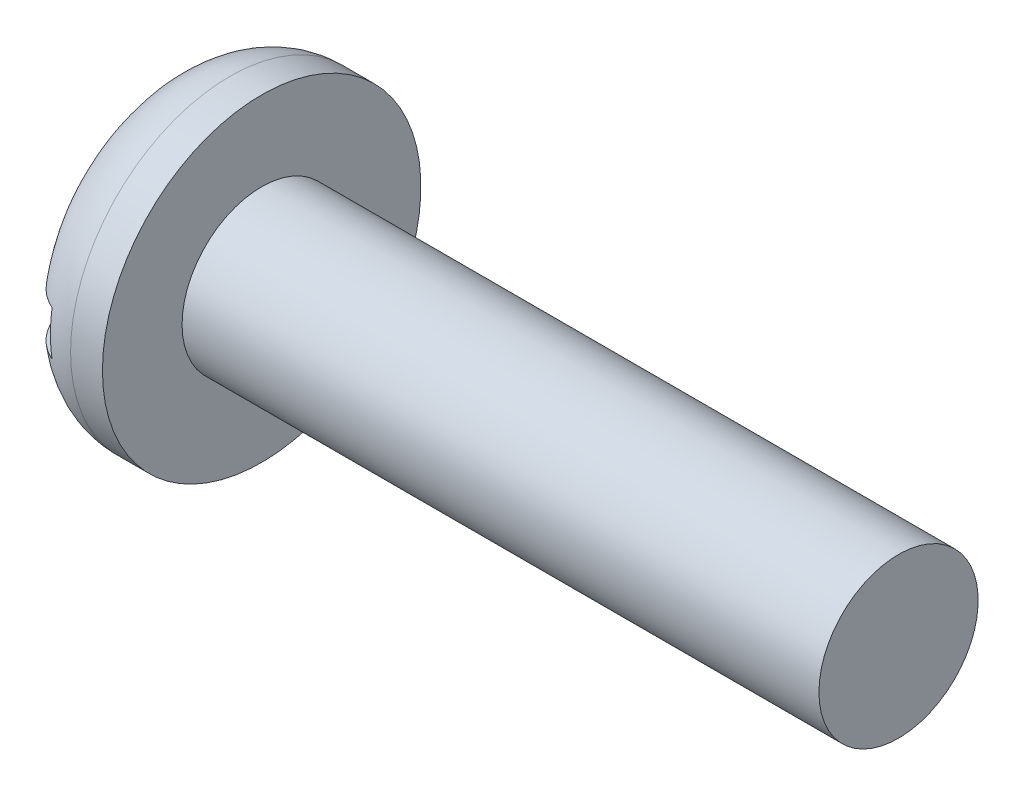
from build123d import *

# Parameters (mm, degrees)
SKETCH2_W  = 20
SKETCH2_H  = 2.8
SLOT_DEPTH = 2.4


with BuildPart() as part:
    # BodySke → Base-Revolve (revolve)
    with BuildSketch(Plane.XY, mode=Mode.PRIVATE) as base_revolve_sk:
        with BuildLine():
            Line((6, 5), (6, 10))
            Line((6, 10), (4, 10))
            ThreePointArc((4, 10), (1.171572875, 8.828427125), (0, 6))
            Line((0, 6), (0, 0))
            Line((0, 0), (46, 0))
            Line((46, 0), (46, 5))
            Line((46, 5), (6, 5))
        make_face()
    revolve(base_revolve_sk.sketch.rotate(Axis((-25.4, 0, 0), (1, 0, 0)), 90), axis=Axis((-25.4, 0, 0), (1, 0, 0)))

    # Sketch2 → Slot (cut)
    with BuildSketch(Plane(origin=(0, 0, 0), x_dir=(0, 0, -1), z_dir=(1, 0, 0))):
        Rectangle(SKETCH2_W, SKETCH2_H)
    extrude(amount=SLOT_DEPTH, mode=Mode.SUBTRACT)


solid = part.part
